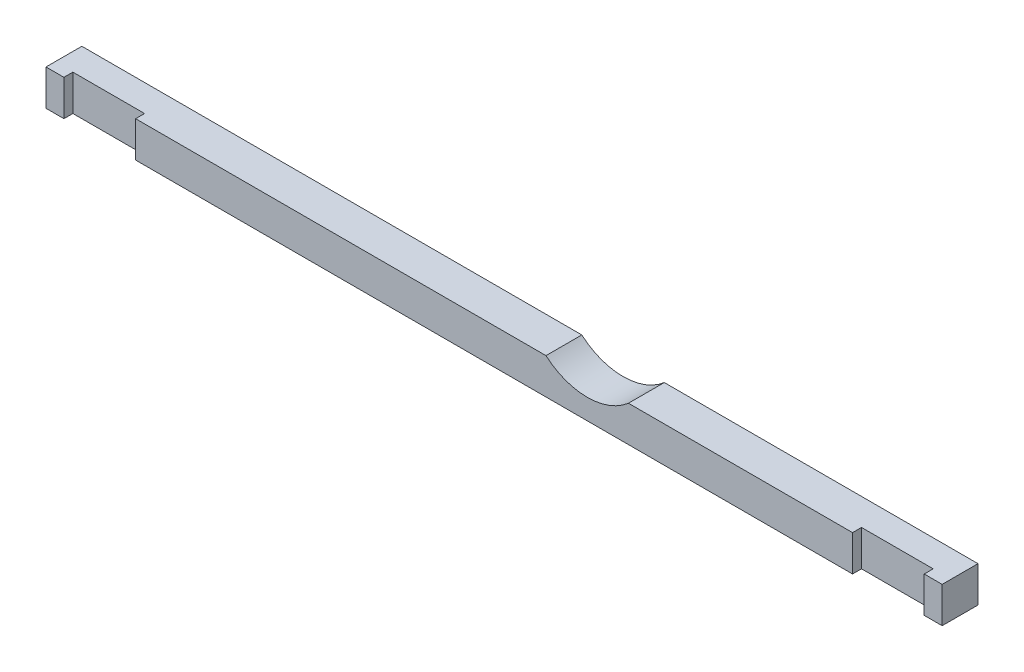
from build123d import *

# Parameters (mm, degrees)
EXTRUDE_1_DEPTH     = 10
SKETCH_2_R          = 17.5
CUT_EXTRUDE_1_DEPTH = 10


with BuildPart() as part:
    # Sketch 1 → Extrude 1 (new body)
    with BuildSketch(Plane(origin=(0, 0, 0), x_dir=(1, 0, 0), z_dir=(0, 1, 0))):
        Polygon((-125, 10), (125, 10), (125, 0), (120, 0), (120, 2.5), (100, 2.5), (100, 0), (-100, 0), (-100, 2.5), (-120, 2.5), (-120, 0), (-125, 0), align=None)
    extrude(amount=EXTRUDE_1_DEPTH)

    # Sketch 2 → Cut-Extrude 1 (cut)
    with BuildSketch(Plane(origin=(0, 0, -10), x_dir=(-1, 0, 0), z_dir=(0, 0, -1))):
        with Locations((-25.980762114, 23.187783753)):
            Circle(SKETCH_2_R)
    extrude(amount=-CUT_EXTRUDE_1_DEPTH, mode=Mode.SUBTRACT)


solid = part.part
